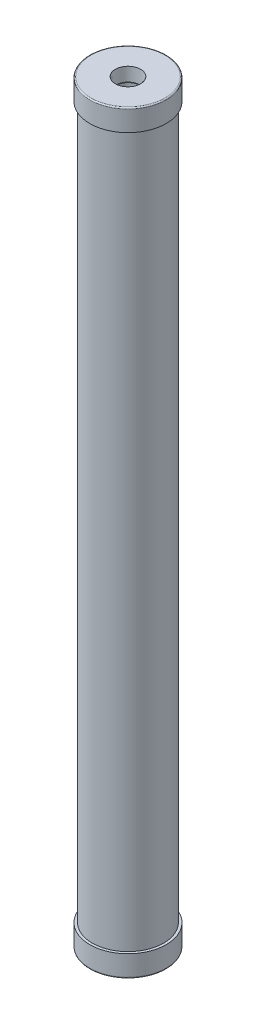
ISO-10303-21;
HEADER;
FILE_DESCRIPTION(('STEP AP214'),'2;1');
FILE_NAME('part.step','',(''),(''),'','','');
FILE_SCHEMA(('AUTOMOTIVE_DESIGN { 1 0 10303 214 1 1 1 1 }'));
ENDSEC;
DATA;
#1=APPLICATION_CONTEXT('core data for automotive mechanical design processes');
#2=APPLICATION_PROTOCOL_DEFINITION('international standard','automotive_design',2000,#1);
#3=PRODUCT_CONTEXT('',#1,'mechanical');
#4=PRODUCT('Part','Part','',(#3));
#5=PRODUCT_RELATED_PRODUCT_CATEGORY('part','',(#4));
#6=PRODUCT_DEFINITION_FORMATION('','',#4);
#7=PRODUCT_DEFINITION_CONTEXT('part definition',#1,'design');
#8=PRODUCT_DEFINITION('design','',#6,#7);
#9=PRODUCT_DEFINITION_SHAPE('','',#8);
#10=(LENGTH_UNIT() NAMED_UNIT(*) SI_UNIT(.MILLI.,.METRE.));
#11=(NAMED_UNIT(*) PLANE_ANGLE_UNIT() SI_UNIT($,.RADIAN.));
#12=(NAMED_UNIT(*) SI_UNIT($,.STERADIAN.) SOLID_ANGLE_UNIT());
#13=UNCERTAINTY_MEASURE_WITH_UNIT(LENGTH_MEASURE(1.E-05),#10,'distance_accuracy_value','');
#14=(GEOMETRIC_REPRESENTATION_CONTEXT(3) GLOBAL_UNCERTAINTY_ASSIGNED_CONTEXT((#13)) GLOBAL_UNIT_ASSIGNED_CONTEXT((#10,
#11,#12)) REPRESENTATION_CONTEXT('',''));
#15=CARTESIAN_POINT('',(0.,0.,0.));
#16=DIRECTION('',(0.,0.,1.));
#17=DIRECTION('',(1.,0.,0.));
#18=AXIS2_PLACEMENT_3D('',#15,#16,#17);
#19=CARTESIAN_POINT('',(0.,939.8,0.));
#20=DIRECTION('',(0.,-1.,0.));
#21=DIRECTION('',(0.,0.,-1.));
#22=AXIS2_PLACEMENT_3D('',#19,#20,#21);
#23=CYLINDRICAL_SURFACE('',#22,44.45);
#24=CARTESIAN_POINT('',(0.,26.9239999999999,0.));
#25=DIRECTION('',(0.,1.,0.));
#26=DIRECTION('',(0.,0.,1.));
#27=AXIS2_PLACEMENT_3D('',#24,#25,#26);
#28=CIRCLE('',#27,44.45);
#29=CARTESIAN_POINT('',(0.,26.9239999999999,44.45));
#30=VERTEX_POINT('',#29);
#31=EDGE_CURVE('E70',#30,#30,#28,.T.);
#32=ORIENTED_EDGE('',*,*,#31,.T.);
#33=EDGE_LOOP('',(#32));
#34=FACE_BOUND('',#33,.T.);
#35=CARTESIAN_POINT('',(0.,912.876,0.));
#36=DIRECTION('',(0.,1.,0.));
#37=DIRECTION('',(0.,0.,1.));
#38=AXIS2_PLACEMENT_3D('',#35,#36,#37);
#39=CIRCLE('',#38,44.45);
#40=CARTESIAN_POINT('',(0.,912.876,44.45));
#41=VERTEX_POINT('',#40);
#42=EDGE_CURVE('E52',#41,#41,#39,.T.);
#43=ORIENTED_EDGE('',*,*,#42,.F.);
#44=EDGE_LOOP('',(#43));
#45=FACE_BOUND('',#44,.T.);
#46=ADVANCED_FACE('F32',(#34,#45),#23,.T.);
#47=CARTESIAN_POINT('',(0.,939.8,0.));
#48=DIRECTION('',(0.,-1.,0.));
#49=DIRECTION('',(0.,0.,-1.));
#50=AXIS2_PLACEMENT_3D('',#47,#48,#49);
#51=CYLINDRICAL_SURFACE('',#50,38.6334);
#52=CARTESIAN_POINT('',(0.,26.9239999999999,0.));
#53=DIRECTION('',(0.,1.,0.));
#54=DIRECTION('',(0.,0.,1.));
#55=AXIS2_PLACEMENT_3D('',#52,#53,#54);
#56=CIRCLE('',#55,38.6334);
#57=CARTESIAN_POINT('',(0.,26.9239999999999,38.6334));
#58=VERTEX_POINT('',#57);
#59=EDGE_CURVE('E67',#58,#58,#56,.T.);
#60=ORIENTED_EDGE('',*,*,#59,.F.);
#61=EDGE_LOOP('',(#60));
#62=FACE_BOUND('',#61,.T.);
#63=CARTESIAN_POINT('',(0.,912.876,0.));
#64=DIRECTION('',(0.,1.,0.));
#65=DIRECTION('',(0.,0.,1.));
#66=AXIS2_PLACEMENT_3D('',#63,#64,#65);
#67=CIRCLE('',#66,38.6334);
#68=CARTESIAN_POINT('',(0.,912.876,38.6334));
#69=VERTEX_POINT('',#68);
#70=EDGE_CURVE('E58',#69,#69,#67,.T.);
#71=ORIENTED_EDGE('',*,*,#70,.T.);
#72=EDGE_LOOP('',(#71));
#73=FACE_BOUND('',#72,.T.);
#74=ADVANCED_FACE('F114',(#62,#73),#51,.F.);
#75=CARTESIAN_POINT('',(0.,26.924,0.));
#76=DIRECTION('',(0.,1.,0.));
#77=DIRECTION('',(0.,0.,1.));
#78=AXIS2_PLACEMENT_3D('',#75,#76,#77);
#79=PLANE('',#78);
#80=CARTESIAN_POINT('',(0.,26.924,0.));
#81=DIRECTION('',(0.,1.,0.));
#82=DIRECTION('',(0.,0.,1.));
#83=AXIS2_PLACEMENT_3D('',#80,#81,#82);
#84=CIRCLE('',#83,14.4907);
#85=CARTESIAN_POINT('',(0.,26.924,14.4907));
#86=VERTEX_POINT('',#85);
#87=EDGE_CURVE('E62',#86,#86,#84,.T.);
#88=ORIENTED_EDGE('',*,*,#87,.F.);
#89=EDGE_LOOP('',(#88));
#90=FACE_BOUND('',#89,.T.);
#91=ORIENTED_EDGE('',*,*,#59,.T.);
#92=EDGE_LOOP('',(#91));
#93=FACE_BOUND('',#92,.T.);
#94=ADVANCED_FACE('F120',(#90,#93),#79,.T.);
#95=CARTESIAN_POINT('',(0.,26.924,0.));
#96=DIRECTION('',(0.,1.,0.));
#97=DIRECTION('',(0.,0.,1.));
#98=AXIS2_PLACEMENT_3D('',#95,#96,#97);
#99=CIRCLE('',#98,47.625);
#100=CARTESIAN_POINT('',(0.,26.924,47.625));
#101=VERTEX_POINT('',#100);
#102=EDGE_CURVE('E65',#101,#101,#99,.T.);
#103=ORIENTED_EDGE('',*,*,#102,.T.);
#104=EDGE_LOOP('',(#103));
#105=FACE_BOUND('',#104,.T.);
#106=ORIENTED_EDGE('',*,*,#31,.F.);
#107=EDGE_LOOP('',(#106));
#108=FACE_BOUND('',#107,.T.);
#109=ADVANCED_FACE('F141',(#105,#108),#79,.T.);
#110=CARTESIAN_POINT('',(0.,26.924,0.));
#111=DIRECTION('',(0.,-1.,0.));
#112=DIRECTION('',(0.,0.,-1.));
#113=AXIS2_PLACEMENT_3D('',#110,#111,#112);
#114=CYLINDRICAL_SURFACE('',#113,47.625);
#115=CARTESIAN_POINT('',(0.,1.524,0.));
#116=DIRECTION('',(0.,1.,0.));
#117=DIRECTION('',(0.,0.,1.));
#118=AXIS2_PLACEMENT_3D('',#115,#116,#117);
#119=CIRCLE('',#118,47.625);
#120=CARTESIAN_POINT('',(0.,1.524,47.625));
#121=VERTEX_POINT('',#120);
#122=EDGE_CURVE('E47',#121,#121,#119,.T.);
#123=ORIENTED_EDGE('',*,*,#122,.T.);
#124=EDGE_LOOP('',(#123));
#125=FACE_BOUND('',#124,.T.);
#126=ORIENTED_EDGE('',*,*,#102,.F.);
#127=EDGE_LOOP('',(#126));
#128=FACE_BOUND('',#127,.T.);
#129=ADVANCED_FACE('F138',(#125,#128),#114,.T.);
#130=CARTESIAN_POINT('',(0.,0.,0.));
#131=DIRECTION('',(0.,1.,0.));
#132=DIRECTION('',(0.,0.,1.));
#133=AXIS2_PLACEMENT_3D('',#130,#131,#132);
#134=PLANE('',#133);
#135=CARTESIAN_POINT('',(0.,0.,0.));
#136=DIRECTION('',(0.,1.,0.));
#137=DIRECTION('',(0.,0.,1.));
#138=AXIS2_PLACEMENT_3D('',#135,#136,#137);
#139=CIRCLE('',#138,46.101);
#140=CARTESIAN_POINT('',(0.,0.,46.101));
#141=VERTEX_POINT('',#140);
#142=EDGE_CURVE('E43',#141,#141,#139,.F.);
#143=ORIENTED_EDGE('',*,*,#142,.T.);
#144=EDGE_LOOP('',(#143));
#145=FACE_BOUND('',#144,.T.);
#146=CARTESIAN_POINT('',(0.,0.,0.));
#147=DIRECTION('',(0.,-1.,0.));
#148=DIRECTION('',(0.,0.,-1.));
#149=AXIS2_PLACEMENT_3D('',#146,#147,#148);
#150=CIRCLE('',#149,15.7299152);
#151=CARTESIAN_POINT('',(0.,0.,-15.7299152));
#152=VERTEX_POINT('',#151);
#153=EDGE_CURVE('E61',#152,#152,#150,.T.);
#154=ORIENTED_EDGE('',*,*,#153,.F.);
#155=EDGE_LOOP('',(#154));
#156=FACE_BOUND('',#155,.T.);
#157=ADVANCED_FACE('F123',(#145,#156),#134,.F.);
#158=CARTESIAN_POINT('',(0.,0.,0.));
#159=DIRECTION('',(0.,-1.,0.));
#160=DIRECTION('',(0.,0.,-1.));
#161=AXIS2_PLACEMENT_3D('',#158,#159,#160);
#162=CYLINDRICAL_SURFACE('',#161,14.4907);
#163=ORIENTED_EDGE('',*,*,#87,.T.);
#164=EDGE_LOOP('',(#163));
#165=FACE_BOUND('',#164,.T.);
#166=CARTESIAN_POINT('',(0.,16.764,0.));
#167=DIRECTION('',(0.,-1.,0.));
#168=DIRECTION('',(0.,0.,-1.));
#169=AXIS2_PLACEMENT_3D('',#166,#167,#168);
#170=CIRCLE('',#169,14.4907);
#171=CARTESIAN_POINT('',(0.,16.764,-14.4907));
#172=VERTEX_POINT('',#171);
#173=EDGE_CURVE('E66',#172,#172,#170,.T.);
#174=ORIENTED_EDGE('',*,*,#173,.T.);
#175=EDGE_LOOP('',(#174));
#176=FACE_BOUND('',#175,.T.);
#177=ADVANCED_FACE('F154',(#165,#176),#162,.F.);
#178=CARTESIAN_POINT('',(14.4907,16.764,0.));
#179=DIRECTION('',(0.,1.,0.));
#180=DIRECTION('',(0.,0.,1.));
#181=AXIS2_PLACEMENT_3D('',#178,#179,#180);
#182=PLANE('',#181);
#183=ORIENTED_EDGE('',*,*,#173,.F.);
#184=EDGE_LOOP('',(#183));
#185=FACE_BOUND('',#184,.T.);
#186=CARTESIAN_POINT('',(0.,16.764,0.));
#187=DIRECTION('',(0.,-1.,0.));
#188=DIRECTION('',(0.,0.,-1.));
#189=AXIS2_PLACEMENT_3D('',#186,#187,#188);
#190=CIRCLE('',#189,15.2279785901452);
#191=CARTESIAN_POINT('',(0.,16.764,-15.2279785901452));
#192=VERTEX_POINT('',#191);
#193=EDGE_CURVE('E77',#192,#192,#190,.T.);
#194=ORIENTED_EDGE('',*,*,#193,.T.);
#195=EDGE_LOOP('',(#194));
#196=FACE_BOUND('',#195,.T.);
#197=ADVANCED_FACE('F157',(#185,#196),#182,.F.);
#198=CARTESIAN_POINT('',(0.,0.,0.));
#199=DIRECTION('',(0.,-1.,0.));
#200=DIRECTION('',(0.,0.,-1.));
#201=AXIS2_PLACEMENT_3D('',#198,#199,#200);
#202=CONICAL_SURFACE('',#201,15.7299152,0.0299323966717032);
#203=ORIENTED_EDGE('',*,*,#193,.F.);
#204=EDGE_LOOP('',(#203));
#205=FACE_BOUND('',#204,.T.);
#206=ORIENTED_EDGE('',*,*,#153,.T.);
#207=EDGE_LOOP('',(#206));
#208=FACE_BOUND('',#207,.T.);
#209=ADVANCED_FACE('F161',(#205,#208),#202,.F.);
#210=CARTESIAN_POINT('',(0.,912.876,0.));
#211=DIRECTION('',(0.,1.,0.));
#212=DIRECTION('',(0.,0.,1.));
#213=AXIS2_PLACEMENT_3D('',#210,#211,#212);
#214=PLANE('',#213);
#215=CARTESIAN_POINT('',(0.,912.876,0.));
#216=DIRECTION('',(0.,1.,0.));
#217=DIRECTION('',(0.,0.,1.));
#218=AXIS2_PLACEMENT_3D('',#215,#216,#217);
#219=CIRCLE('',#218,14.4907);
#220=CARTESIAN_POINT('',(0.,912.876,14.4907));
#221=VERTEX_POINT('',#220);
#222=EDGE_CURVE('E53',#221,#221,#219,.T.);
#223=ORIENTED_EDGE('',*,*,#222,.T.);
#224=EDGE_LOOP('',(#223));
#225=FACE_BOUND('',#224,.T.);
#226=ORIENTED_EDGE('',*,*,#70,.F.);
#227=EDGE_LOOP('',(#226));
#228=FACE_BOUND('',#227,.T.);
#229=ADVANCED_FACE('F164',(#225,#228),#214,.F.);
#230=CARTESIAN_POINT('',(0.,912.876,0.));
#231=DIRECTION('',(0.,1.,0.));
#232=DIRECTION('',(0.,0.,1.));
#233=AXIS2_PLACEMENT_3D('',#230,#231,#232);
#234=CIRCLE('',#233,47.625);
#235=CARTESIAN_POINT('',(0.,912.876,47.625));
#236=VERTEX_POINT('',#235);
#237=EDGE_CURVE('E56',#236,#236,#234,.T.);
#238=ORIENTED_EDGE('',*,*,#237,.F.);
#239=EDGE_LOOP('',(#238));
#240=FACE_BOUND('',#239,.T.);
#241=ORIENTED_EDGE('',*,*,#42,.T.);
#242=EDGE_LOOP('',(#241));
#243=FACE_BOUND('',#242,.T.);
#244=ADVANCED_FACE('F109',(#240,#243),#214,.F.);
#245=CARTESIAN_POINT('',(0.,912.876,0.));
#246=DIRECTION('',(0.,1.,0.));
#247=DIRECTION('',(0.,0.,1.));
#248=AXIS2_PLACEMENT_3D('',#245,#246,#247);
#249=CYLINDRICAL_SURFACE('',#248,47.625);
#250=CARTESIAN_POINT('',(0.,938.276,0.));
#251=DIRECTION('',(0.,1.,0.));
#252=DIRECTION('',(0.,0.,1.));
#253=AXIS2_PLACEMENT_3D('',#250,#251,#252);
#254=CIRCLE('',#253,47.625);
#255=CARTESIAN_POINT('',(0.,938.276,47.625));
#256=VERTEX_POINT('',#255);
#257=EDGE_CURVE('E10',#256,#256,#254,.F.);
#258=ORIENTED_EDGE('',*,*,#257,.T.);
#259=EDGE_LOOP('',(#258));
#260=FACE_BOUND('',#259,.T.);
#261=ORIENTED_EDGE('',*,*,#237,.T.);
#262=EDGE_LOOP('',(#261));
#263=FACE_BOUND('',#262,.T.);
#264=ADVANCED_FACE('F100',(#260,#263),#249,.T.);
#265=CARTESIAN_POINT('',(0.,939.8,0.));
#266=DIRECTION('',(0.,1.,0.));
#267=DIRECTION('',(0.,0.,1.));
#268=AXIS2_PLACEMENT_3D('',#265,#266,#267);
#269=PLANE('',#268);
#270=CARTESIAN_POINT('',(0.,939.8,0.));
#271=DIRECTION('',(0.,1.,0.));
#272=DIRECTION('',(0.,0.,1.));
#273=AXIS2_PLACEMENT_3D('',#270,#271,#272);
#274=CIRCLE('',#273,46.101);
#275=CARTESIAN_POINT('',(0.,939.8,46.101));
#276=VERTEX_POINT('',#275);
#277=EDGE_CURVE('E39',#276,#276,#274,.T.);
#278=ORIENTED_EDGE('',*,*,#277,.T.);
#279=EDGE_LOOP('',(#278));
#280=FACE_BOUND('',#279,.T.);
#281=CARTESIAN_POINT('',(0.,939.8,0.));
#282=DIRECTION('',(0.,1.,0.));
#283=DIRECTION('',(0.,0.,1.));
#284=AXIS2_PLACEMENT_3D('',#281,#282,#283);
#285=CIRCLE('',#284,15.7299152);
#286=CARTESIAN_POINT('',(0.,939.8,15.7299152));
#287=VERTEX_POINT('',#286);
#288=EDGE_CURVE('E91',#287,#287,#285,.T.);
#289=ORIENTED_EDGE('',*,*,#288,.F.);
#290=EDGE_LOOP('',(#289));
#291=FACE_BOUND('',#290,.T.);
#292=ADVANCED_FACE('F97',(#280,#291),#269,.T.);
#293=CARTESIAN_POINT('',(0.,939.8,0.));
#294=DIRECTION('',(0.,1.,0.));
#295=DIRECTION('',(0.,0.,1.));
#296=AXIS2_PLACEMENT_3D('',#293,#294,#295);
#297=CYLINDRICAL_SURFACE('',#296,14.4907);
#298=CARTESIAN_POINT('',(0.,923.036,0.));
#299=DIRECTION('',(0.,1.,0.));
#300=DIRECTION('',(0.,0.,1.));
#301=AXIS2_PLACEMENT_3D('',#298,#299,#300);
#302=CIRCLE('',#301,14.4907);
#303=CARTESIAN_POINT('',(0.,923.036,14.4907));
#304=VERTEX_POINT('',#303);
#305=EDGE_CURVE('E57',#304,#304,#302,.T.);
#306=ORIENTED_EDGE('',*,*,#305,.T.);
#307=EDGE_LOOP('',(#306));
#308=FACE_BOUND('',#307,.T.);
#309=ORIENTED_EDGE('',*,*,#222,.F.);
#310=EDGE_LOOP('',(#309));
#311=FACE_BOUND('',#310,.T.);
#312=ADVANCED_FACE('F99',(#308,#311),#297,.F.);
#313=CARTESIAN_POINT('',(14.4907,923.036,0.));
#314=DIRECTION('',(0.,-1.,0.));
#315=DIRECTION('',(0.,0.,-1.));
#316=AXIS2_PLACEMENT_3D('',#313,#314,#315);
#317=PLANE('',#316);
#318=ORIENTED_EDGE('',*,*,#305,.F.);
#319=EDGE_LOOP('',(#318));
#320=FACE_BOUND('',#319,.T.);
#321=CARTESIAN_POINT('',(0.,923.036,0.));
#322=DIRECTION('',(0.,1.,0.));
#323=DIRECTION('',(0.,0.,1.));
#324=AXIS2_PLACEMENT_3D('',#321,#322,#323);
#325=CIRCLE('',#324,15.2279785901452);
#326=CARTESIAN_POINT('',(0.,923.036,15.2279785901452));
#327=VERTEX_POINT('',#326);
#328=EDGE_CURVE('E88',#327,#327,#325,.T.);
#329=ORIENTED_EDGE('',*,*,#328,.T.);
#330=EDGE_LOOP('',(#329));
#331=FACE_BOUND('',#330,.T.);
#332=ADVANCED_FACE('F106',(#320,#331),#317,.F.);
#333=CARTESIAN_POINT('',(0.,939.8,0.));
#334=DIRECTION('',(0.,1.,0.));
#335=DIRECTION('',(0.,0.,1.));
#336=AXIS2_PLACEMENT_3D('',#333,#334,#335);
#337=CONICAL_SURFACE('',#336,15.7299152,0.0299323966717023);
#338=ORIENTED_EDGE('',*,*,#328,.F.);
#339=EDGE_LOOP('',(#338));
#340=FACE_BOUND('',#339,.T.);
#341=ORIENTED_EDGE('',*,*,#288,.T.);
#342=EDGE_LOOP('',(#341));
#343=FACE_BOUND('',#342,.T.);
#344=ADVANCED_FACE('F95',(#340,#343),#337,.F.);
#345=CARTESIAN_POINT('',(0.,1.524,0.));
#346=DIRECTION('',(0.,1.,0.));
#347=DIRECTION('',(0.,0.,1.));
#348=AXIS2_PLACEMENT_3D('',#345,#346,#347);
#349=TOROIDAL_SURFACE('',#348,46.101,1.524);
#350=ORIENTED_EDGE('',*,*,#142,.F.);
#351=EDGE_LOOP('',(#350));
#352=FACE_BOUND('',#351,.T.);
#353=ORIENTED_EDGE('',*,*,#122,.F.);
#354=EDGE_LOOP('',(#353));
#355=FACE_BOUND('',#354,.T.);
#356=ADVANCED_FACE('F124',(#352,#355),#349,.T.);
#357=CARTESIAN_POINT('',(0.,938.276,0.));
#358=DIRECTION('',(0.,1.,0.));
#359=DIRECTION('',(0.,0.,1.));
#360=AXIS2_PLACEMENT_3D('',#357,#358,#359);
#361=TOROIDAL_SURFACE('',#360,46.101,1.524);
#362=ORIENTED_EDGE('',*,*,#257,.F.);
#363=EDGE_LOOP('',(#362));
#364=FACE_BOUND('',#363,.T.);
#365=ORIENTED_EDGE('',*,*,#277,.F.);
#366=EDGE_LOOP('',(#365));
#367=FACE_BOUND('',#366,.T.);
#368=ADVANCED_FACE('F34',(#364,#367),#361,.T.);
#369=CLOSED_SHELL('',(#46,#74,#94,#109,#129,#157,#177,#197,#209,#229,#244,#264,#292,#312,#332,
#344,#356,#368));
#370=MANIFOLD_SOLID_BREP('B2',#369);
#371=ADVANCED_BREP_SHAPE_REPRESENTATION('',(#18,#370),#14);
#372=SHAPE_DEFINITION_REPRESENTATION(#9,#371);
ENDSEC;
END-ISO-10303-21;
